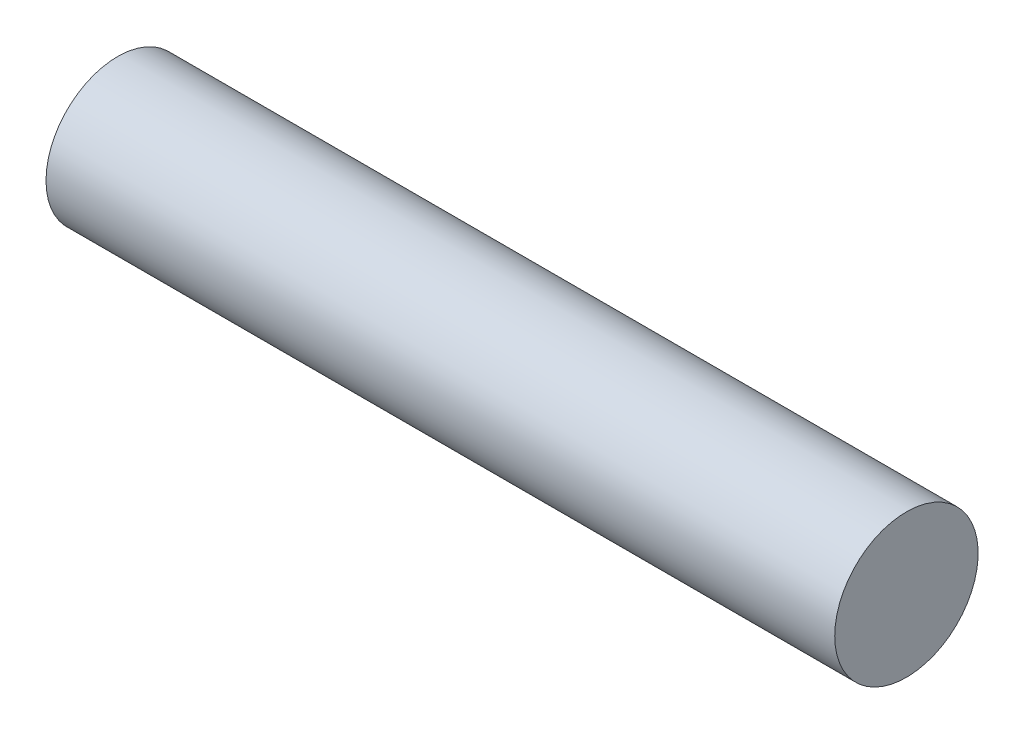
from build123d import *


with BuildPart() as part:
    # Sketch 1 → Revolve 1 (revolve)
    with BuildSketch(Plane(origin=(0, 0, 0), x_dir=(1, 0, 0), z_dir=(0, 1, 0)), mode=Mode.PRIVATE) as revolve_1_sk:
        Polygon((0, 0), (55, 0), (55, 5), (29, 5), (20, 5), (0, 5), align=None)
    revolve(revolve_1_sk.sketch.rotate(Axis((0, 0, 0), (1, 0, 0)), 180), axis=Axis((0, 0, 0), (1, 0, 0)))


solid = part.part
